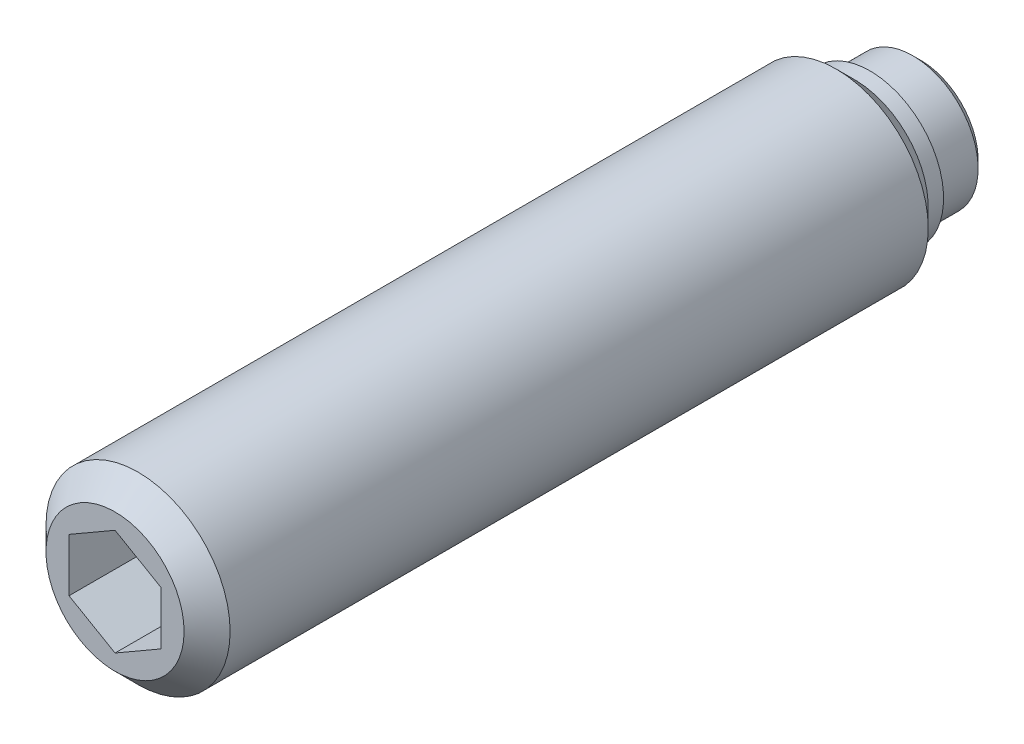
ISO-10303-21;
HEADER;
FILE_DESCRIPTION(('STEP AP214'),'2;1');
FILE_NAME('part.step','',(''),(''),'','','');
FILE_SCHEMA(('AUTOMOTIVE_DESIGN { 1 0 10303 214 1 1 1 1 }'));
ENDSEC;
DATA;
#1=APPLICATION_CONTEXT('core data for automotive mechanical design processes');
#2=APPLICATION_PROTOCOL_DEFINITION('international standard','automotive_design',2000,#1);
#3=PRODUCT_CONTEXT('',#1,'mechanical');
#4=PRODUCT('Part','Part','',(#3));
#5=PRODUCT_RELATED_PRODUCT_CATEGORY('part','',(#4));
#6=PRODUCT_DEFINITION_FORMATION('','',#4);
#7=PRODUCT_DEFINITION_CONTEXT('part definition',#1,'design');
#8=PRODUCT_DEFINITION('design','',#6,#7);
#9=PRODUCT_DEFINITION_SHAPE('','',#8);
#10=(LENGTH_UNIT() NAMED_UNIT(*) SI_UNIT(.MILLI.,.METRE.));
#11=(NAMED_UNIT(*) PLANE_ANGLE_UNIT() SI_UNIT($,.RADIAN.));
#12=(NAMED_UNIT(*) SI_UNIT($,.STERADIAN.) SOLID_ANGLE_UNIT());
#13=UNCERTAINTY_MEASURE_WITH_UNIT(LENGTH_MEASURE(1.E-05),#10,'distance_accuracy_value','');
#14=(GEOMETRIC_REPRESENTATION_CONTEXT(3) GLOBAL_UNCERTAINTY_ASSIGNED_CONTEXT((#13)) GLOBAL_UNIT_ASSIGNED_CONTEXT((#10,
#11,#12)) REPRESENTATION_CONTEXT('',''));
#15=CARTESIAN_POINT('',(0.,0.,0.));
#16=DIRECTION('',(0.,0.,1.));
#17=DIRECTION('',(1.,0.,0.));
#18=AXIS2_PLACEMENT_3D('',#15,#16,#17);
#19=CARTESIAN_POINT('',(0.,0.,3.3));
#20=DIRECTION('',(0.,0.,-1.));
#21=DIRECTION('',(-1.,0.,0.));
#22=AXIS2_PLACEMENT_3D('',#19,#20,#21);
#23=CYLINDRICAL_SURFACE('',#22,6.);
#24=CARTESIAN_POINT('',(0.,0.,5.5));
#25=DIRECTION('',(0.,0.,-1.));
#26=DIRECTION('',(-1.,0.,0.));
#27=AXIS2_PLACEMENT_3D('',#24,#25,#26);
#28=CIRCLE('',#27,6.);
#29=CARTESIAN_POINT('',(-6.,0.,5.5));
#30=VERTEX_POINT('',#29);
#31=EDGE_CURVE('E9',#30,#30,#28,.T.);
#32=ORIENTED_EDGE('',*,*,#31,.F.);
#33=EDGE_LOOP('',(#32));
#34=FACE_BOUND('',#33,.T.);
#35=CARTESIAN_POINT('',(0.,0.,51.));
#36=DIRECTION('',(0.,0.,1.));
#37=DIRECTION('',(1.,0.,0.));
#38=AXIS2_PLACEMENT_3D('',#35,#36,#37);
#39=CIRCLE('',#38,6.);
#40=CARTESIAN_POINT('',(6.,0.,51.));
#41=VERTEX_POINT('',#40);
#42=EDGE_CURVE('E123',#41,#41,#39,.T.);
#43=ORIENTED_EDGE('',*,*,#42,.F.);
#44=EDGE_LOOP('',(#43));
#45=FACE_BOUND('',#44,.T.);
#46=ADVANCED_FACE('F14',(#34,#45),#23,.T.);
#47=CARTESIAN_POINT('',(0.,0.,5.5));
#48=DIRECTION('',(0.,0.,1.));
#49=DIRECTION('',(1.,0.,0.));
#50=AXIS2_PLACEMENT_3D('',#47,#48,#49);
#51=CONICAL_SURFACE('',#50,6.,0.785398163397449);
#52=ORIENTED_EDGE('',*,*,#31,.T.);
#53=EDGE_LOOP('',(#52));
#54=FACE_BOUND('',#53,.T.);
#55=CARTESIAN_POINT('',(0.,0.,4.3));
#56=DIRECTION('',(0.,0.,-1.));
#57=DIRECTION('',(-1.,0.,0.));
#58=AXIS2_PLACEMENT_3D('',#55,#56,#57);
#59=CIRCLE('',#58,4.8);
#60=CARTESIAN_POINT('',(-4.8,0.,4.3));
#61=VERTEX_POINT('',#60);
#62=EDGE_CURVE('E21',#61,#61,#59,.T.);
#63=ORIENTED_EDGE('',*,*,#62,.F.);
#64=EDGE_LOOP('',(#63));
#65=FACE_BOUND('',#64,.T.);
#66=ADVANCED_FACE('F143',(#54,#65),#51,.T.);
#67=CARTESIAN_POINT('',(0.,0.,3.3));
#68=DIRECTION('',(0.,0.,-1.));
#69=DIRECTION('',(-1.,0.,0.));
#70=AXIS2_PLACEMENT_3D('',#67,#68,#69);
#71=CYLINDRICAL_SURFACE('',#70,4.8);
#72=ORIENTED_EDGE('',*,*,#62,.T.);
#73=EDGE_LOOP('',(#72));
#74=FACE_BOUND('',#73,.T.);
#75=CARTESIAN_POINT('',(0.,0.,3.3));
#76=DIRECTION('',(0.,0.,-1.));
#77=DIRECTION('',(-1.,0.,0.));
#78=AXIS2_PLACEMENT_3D('',#75,#76,#77);
#79=CIRCLE('',#78,4.8);
#80=CARTESIAN_POINT('',(-4.8,0.,3.3));
#81=VERTEX_POINT('',#80);
#82=EDGE_CURVE('E135',#81,#81,#79,.T.);
#83=ORIENTED_EDGE('',*,*,#82,.F.);
#84=EDGE_LOOP('',(#83));
#85=FACE_BOUND('',#84,.T.);
#86=ADVANCED_FACE('F140',(#74,#85),#71,.T.);
#87=CARTESIAN_POINT('',(0.,4.8,3.3));
#88=DIRECTION('',(0.,0.,1.));
#89=DIRECTION('',(1.,0.,0.));
#90=AXIS2_PLACEMENT_3D('',#87,#88,#89);
#91=PLANE('',#90);
#92=ORIENTED_EDGE('',*,*,#82,.T.);
#93=EDGE_LOOP('',(#92));
#94=FACE_BOUND('',#93,.T.);
#95=CARTESIAN_POINT('',(0.,0.,3.3));
#96=DIRECTION('',(0.,0.,-1.));
#97=DIRECTION('',(-1.,0.,0.));
#98=AXIS2_PLACEMENT_3D('',#95,#96,#97);
#99=CIRCLE('',#98,4.25);
#100=CARTESIAN_POINT('',(-4.25,0.,3.3));
#101=VERTEX_POINT('',#100);
#102=EDGE_CURVE('E132',#101,#101,#99,.T.);
#103=ORIENTED_EDGE('',*,*,#102,.F.);
#104=EDGE_LOOP('',(#103));
#105=FACE_BOUND('',#104,.T.);
#106=ADVANCED_FACE('F151',(#94,#105),#91,.F.);
#107=CARTESIAN_POINT('',(0.,0.,0.));
#108=DIRECTION('',(0.,0.,-1.));
#109=DIRECTION('',(-1.,0.,0.));
#110=AXIS2_PLACEMENT_3D('',#107,#108,#109);
#111=CYLINDRICAL_SURFACE('',#110,4.25);
#112=CARTESIAN_POINT('',(0.,0.,0.5));
#113=DIRECTION('',(0.,0.,-1.));
#114=DIRECTION('',(-1.,0.,0.));
#115=AXIS2_PLACEMENT_3D('',#112,#113,#114);
#116=CIRCLE('',#115,4.25);
#117=CARTESIAN_POINT('',(-4.25,0.,0.5));
#118=VERTEX_POINT('',#117);
#119=EDGE_CURVE('E129',#118,#118,#116,.T.);
#120=ORIENTED_EDGE('',*,*,#119,.F.);
#121=EDGE_LOOP('',(#120));
#122=FACE_BOUND('',#121,.T.);
#123=ORIENTED_EDGE('',*,*,#102,.T.);
#124=EDGE_LOOP('',(#123));
#125=FACE_BOUND('',#124,.T.);
#126=ADVANCED_FACE('F157',(#122,#125),#111,.T.);
#127=CARTESIAN_POINT('',(0.,0.,0.5));
#128=DIRECTION('',(0.,0.,1.));
#129=DIRECTION('',(1.,0.,0.));
#130=AXIS2_PLACEMENT_3D('',#127,#128,#129);
#131=CONICAL_SURFACE('',#130,4.25,0.785398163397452);
#132=CARTESIAN_POINT('',(0.,0.,0.));
#133=DIRECTION('',(0.,0.,-1.));
#134=DIRECTION('',(-1.,0.,0.));
#135=AXIS2_PLACEMENT_3D('',#132,#133,#134);
#136=CIRCLE('',#135,3.75);
#137=CARTESIAN_POINT('',(-3.75,0.,0.));
#138=VERTEX_POINT('',#137);
#139=EDGE_CURVE('E126',#138,#138,#136,.T.);
#140=ORIENTED_EDGE('',*,*,#139,.F.);
#141=EDGE_LOOP('',(#140));
#142=FACE_BOUND('',#141,.T.);
#143=ORIENTED_EDGE('',*,*,#119,.T.);
#144=EDGE_LOOP('',(#143));
#145=FACE_BOUND('',#144,.T.);
#146=ADVANCED_FACE('F161',(#142,#145),#131,.T.);
#147=CARTESIAN_POINT('',(0.,3.75,0.));
#148=DIRECTION('',(0.,0.,1.));
#149=DIRECTION('',(1.,0.,0.));
#150=AXIS2_PLACEMENT_3D('',#147,#148,#149);
#151=PLANE('',#150);
#152=ORIENTED_EDGE('',*,*,#139,.T.);
#153=EDGE_LOOP('',(#152));
#154=FACE_BOUND('',#153,.T.);
#155=ADVANCED_FACE('F165',(#154),#151,.F.);
#156=CARTESIAN_POINT('',(0.,0.,52.5));
#157=DIRECTION('',(0.,0.,-1.));
#158=DIRECTION('',(-1.,0.,0.));
#159=AXIS2_PLACEMENT_3D('',#156,#157,#158);
#160=CONICAL_SURFACE('',#159,4.5,0.78539816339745);
#161=ORIENTED_EDGE('',*,*,#42,.T.);
#162=EDGE_LOOP('',(#161));
#163=FACE_BOUND('',#162,.T.);
#164=CARTESIAN_POINT('',(0.,0.,52.5));
#165=DIRECTION('',(0.,0.,1.));
#166=DIRECTION('',(1.,0.,0.));
#167=AXIS2_PLACEMENT_3D('',#164,#165,#166);
#168=CIRCLE('',#167,4.5);
#169=CARTESIAN_POINT('',(4.5,0.,52.5));
#170=VERTEX_POINT('',#169);
#171=EDGE_CURVE('E115',#170,#170,#168,.T.);
#172=ORIENTED_EDGE('',*,*,#171,.F.);
#173=EDGE_LOOP('',(#172));
#174=FACE_BOUND('',#173,.T.);
#175=ADVANCED_FACE('F169',(#163,#174),#160,.T.);
#176=CARTESIAN_POINT('',(0.,-4.5,52.5));
#177=DIRECTION('',(0.,0.,1.));
#178=DIRECTION('',(1.,0.,0.));
#179=AXIS2_PLACEMENT_3D('',#176,#177,#178);
#180=PLANE('',#179);
#181=DIRECTION('',(0.866025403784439,-0.5,0.));
#182=VECTOR('',#181,1.);
#183=CARTESIAN_POINT('',(-3.,-1.73205080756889,52.5));
#184=LINE('',#183,#182);
#185=CARTESIAN_POINT('',(-3.,-1.73205080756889,52.5));
#186=VERTEX_POINT('',#185);
#187=CARTESIAN_POINT('',(0.,-3.46410161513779,52.5));
#188=VERTEX_POINT('',#187);
#189=EDGE_CURVE('E28',#186,#188,#184,.T.);
#190=ORIENTED_EDGE('',*,*,#189,.F.);
#191=DIRECTION('',(0.,-1.,0.));
#192=VECTOR('',#191,1.);
#193=CARTESIAN_POINT('',(-3.,1.73205080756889,52.5));
#194=LINE('',#193,#192);
#195=CARTESIAN_POINT('',(-3.,1.73205080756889,52.5));
#196=VERTEX_POINT('',#195);
#197=EDGE_CURVE('E111',#196,#186,#194,.T.);
#198=ORIENTED_EDGE('',*,*,#197,.F.);
#199=DIRECTION('',(-0.866025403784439,-0.5,0.));
#200=VECTOR('',#199,1.);
#201=CARTESIAN_POINT('',(0.,3.46410161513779,52.5));
#202=LINE('',#201,#200);
#203=CARTESIAN_POINT('',(0.,3.46410161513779,52.5));
#204=VERTEX_POINT('',#203);
#205=EDGE_CURVE('E109',#204,#196,#202,.T.);
#206=ORIENTED_EDGE('',*,*,#205,.F.);
#207=DIRECTION('',(-0.866025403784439,0.5,0.));
#208=VECTOR('',#207,1.);
#209=CARTESIAN_POINT('',(3.,1.73205080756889,52.5));
#210=LINE('',#209,#208);
#211=CARTESIAN_POINT('',(3.,1.73205080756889,52.5));
#212=VERTEX_POINT('',#211);
#213=EDGE_CURVE('E76',#212,#204,#210,.T.);
#214=ORIENTED_EDGE('',*,*,#213,.F.);
#215=DIRECTION('',(0.,1.,0.));
#216=VECTOR('',#215,1.);
#217=CARTESIAN_POINT('',(3.,-1.73205080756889,52.5));
#218=LINE('',#217,#216);
#219=CARTESIAN_POINT('',(3.,-1.73205080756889,52.5));
#220=VERTEX_POINT('',#219);
#221=EDGE_CURVE('E105',#220,#212,#218,.T.);
#222=ORIENTED_EDGE('',*,*,#221,.F.);
#223=DIRECTION('',(0.866025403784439,0.5,0.));
#224=VECTOR('',#223,1.);
#225=CARTESIAN_POINT('',(0.,-3.46410161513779,52.5));
#226=LINE('',#225,#224);
#227=EDGE_CURVE('E102',#188,#220,#226,.T.);
#228=ORIENTED_EDGE('',*,*,#227,.F.);
#229=EDGE_LOOP('',(#190,#198,#206,#214,#222,#228));
#230=FACE_BOUND('',#229,.T.);
#231=ORIENTED_EDGE('',*,*,#171,.T.);
#232=EDGE_LOOP('',(#231));
#233=FACE_BOUND('',#232,.T.);
#234=ADVANCED_FACE('F173',(#230,#233),#180,.T.);
#235=CARTESIAN_POINT('',(-3.,-1.73205080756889,44.5));
#236=DIRECTION('',(-0.5,-0.866025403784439,0.));
#237=DIRECTION('',(0.866025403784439,-0.5,0.));
#238=AXIS2_PLACEMENT_3D('',#235,#236,#237);
#239=PLANE('',#238);
#240=ORIENTED_EDGE('',*,*,#189,.T.);
#241=DIRECTION('',(0.,0.,1.));
#242=VECTOR('',#241,1.);
#243=CARTESIAN_POINT('',(0.,-3.46410161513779,44.5));
#244=LINE('',#243,#242);
#245=CARTESIAN_POINT('',(0.,-3.46410161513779,44.5));
#246=VERTEX_POINT('',#245);
#247=EDGE_CURVE('E58',#246,#188,#244,.T.);
#248=ORIENTED_EDGE('',*,*,#247,.F.);
#249=DIRECTION('',(0.866025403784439,-0.5,0.));
#250=VECTOR('',#249,1.);
#251=CARTESIAN_POINT('',(-3.,-1.73205080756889,44.5));
#252=LINE('',#251,#250);
#253=CARTESIAN_POINT('',(-3.,-1.73205080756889,44.5));
#254=VERTEX_POINT('',#253);
#255=EDGE_CURVE('E113',#254,#246,#252,.T.);
#256=ORIENTED_EDGE('',*,*,#255,.F.);
#257=DIRECTION('',(0.,0.,1.));
#258=VECTOR('',#257,1.);
#259=CARTESIAN_POINT('',(-3.,-1.73205080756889,44.5));
#260=LINE('',#259,#258);
#261=EDGE_CURVE('E36',#254,#186,#260,.T.);
#262=ORIENTED_EDGE('',*,*,#261,.T.);
#263=EDGE_LOOP('',(#240,#248,#256,#262));
#264=FACE_BOUND('',#263,.T.);
#265=ADVANCED_FACE('F177',(#264),#239,.F.);
#266=CARTESIAN_POINT('',(-3.,1.73205080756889,44.5));
#267=DIRECTION('',(-1.,0.,0.));
#268=DIRECTION('',(0.,0.,1.));
#269=AXIS2_PLACEMENT_3D('',#266,#267,#268);
#270=PLANE('',#269);
#271=ORIENTED_EDGE('',*,*,#197,.T.);
#272=ORIENTED_EDGE('',*,*,#261,.F.);
#273=DIRECTION('',(0.,-1.,0.));
#274=VECTOR('',#273,1.);
#275=CARTESIAN_POINT('',(-3.,1.73205080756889,44.5));
#276=LINE('',#275,#274);
#277=CARTESIAN_POINT('',(-3.,1.73205080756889,44.5));
#278=VERTEX_POINT('',#277);
#279=EDGE_CURVE('E88',#278,#254,#276,.T.);
#280=ORIENTED_EDGE('',*,*,#279,.F.);
#281=DIRECTION('',(0.,0.,1.));
#282=VECTOR('',#281,1.);
#283=CARTESIAN_POINT('',(-3.,1.73205080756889,44.5));
#284=LINE('',#283,#282);
#285=EDGE_CURVE('E80',#278,#196,#284,.T.);
#286=ORIENTED_EDGE('',*,*,#285,.T.);
#287=EDGE_LOOP('',(#271,#272,#280,#286));
#288=FACE_BOUND('',#287,.T.);
#289=ADVANCED_FACE('F181',(#288),#270,.F.);
#290=CARTESIAN_POINT('',(0.,3.46410161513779,44.5));
#291=DIRECTION('',(-0.5,0.866025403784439,0.));
#292=DIRECTION('',(-0.866025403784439,-0.5,0.));
#293=AXIS2_PLACEMENT_3D('',#290,#291,#292);
#294=PLANE('',#293);
#295=ORIENTED_EDGE('',*,*,#205,.T.);
#296=ORIENTED_EDGE('',*,*,#285,.F.);
#297=DIRECTION('',(-0.866025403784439,-0.5,0.));
#298=VECTOR('',#297,1.);
#299=CARTESIAN_POINT('',(0.,3.46410161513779,44.5));
#300=LINE('',#299,#298);
#301=CARTESIAN_POINT('',(0.,3.46410161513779,44.5));
#302=VERTEX_POINT('',#301);
#303=EDGE_CURVE('E84',#302,#278,#300,.T.);
#304=ORIENTED_EDGE('',*,*,#303,.F.);
#305=DIRECTION('',(0.,0.,1.));
#306=VECTOR('',#305,1.);
#307=CARTESIAN_POINT('',(0.,3.46410161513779,44.5));
#308=LINE('',#307,#306);
#309=EDGE_CURVE('E69',#302,#204,#308,.T.);
#310=ORIENTED_EDGE('',*,*,#309,.T.);
#311=EDGE_LOOP('',(#295,#296,#304,#310));
#312=FACE_BOUND('',#311,.T.);
#313=ADVANCED_FACE('F85',(#312),#294,.F.);
#314=CARTESIAN_POINT('',(3.,1.73205080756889,44.5));
#315=DIRECTION('',(0.5,0.866025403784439,0.));
#316=DIRECTION('',(-0.866025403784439,0.5,0.));
#317=AXIS2_PLACEMENT_3D('',#314,#315,#316);
#318=PLANE('',#317);
#319=ORIENTED_EDGE('',*,*,#213,.T.);
#320=ORIENTED_EDGE('',*,*,#309,.F.);
#321=DIRECTION('',(-0.866025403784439,0.5,0.));
#322=VECTOR('',#321,1.);
#323=CARTESIAN_POINT('',(3.,1.73205080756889,44.5));
#324=LINE('',#323,#322);
#325=CARTESIAN_POINT('',(3.,1.73205080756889,44.5));
#326=VERTEX_POINT('',#325);
#327=EDGE_CURVE('E73',#326,#302,#324,.T.);
#328=ORIENTED_EDGE('',*,*,#327,.F.);
#329=DIRECTION('',(0.,0.,1.));
#330=VECTOR('',#329,1.);
#331=CARTESIAN_POINT('',(3.,1.73205080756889,44.5));
#332=LINE('',#331,#330);
#333=EDGE_CURVE('E81',#326,#212,#332,.T.);
#334=ORIENTED_EDGE('',*,*,#333,.T.);
#335=EDGE_LOOP('',(#319,#320,#328,#334));
#336=FACE_BOUND('',#335,.T.);
#337=ADVANCED_FACE('F71',(#336),#318,.F.);
#338=CARTESIAN_POINT('',(3.,-1.73205080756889,44.5));
#339=DIRECTION('',(1.,0.,0.));
#340=DIRECTION('',(0.,0.,-1.));
#341=AXIS2_PLACEMENT_3D('',#338,#339,#340);
#342=PLANE('',#341);
#343=ORIENTED_EDGE('',*,*,#221,.T.);
#344=ORIENTED_EDGE('',*,*,#333,.F.);
#345=DIRECTION('',(0.,1.,0.));
#346=VECTOR('',#345,1.);
#347=CARTESIAN_POINT('',(3.,-1.73205080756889,44.5));
#348=LINE('',#347,#346);
#349=CARTESIAN_POINT('',(3.,-1.73205080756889,44.5));
#350=VERTEX_POINT('',#349);
#351=EDGE_CURVE('E94',#350,#326,#348,.T.);
#352=ORIENTED_EDGE('',*,*,#351,.F.);
#353=DIRECTION('',(0.,0.,1.));
#354=VECTOR('',#353,1.);
#355=CARTESIAN_POINT('',(3.,-1.73205080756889,44.5));
#356=LINE('',#355,#354);
#357=EDGE_CURVE('E118',#350,#220,#356,.T.);
#358=ORIENTED_EDGE('',*,*,#357,.T.);
#359=EDGE_LOOP('',(#343,#344,#352,#358));
#360=FACE_BOUND('',#359,.T.);
#361=ADVANCED_FACE('F185',(#360),#342,.F.);
#362=CARTESIAN_POINT('',(0.,-3.46410161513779,44.5));
#363=DIRECTION('',(0.5,-0.866025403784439,0.));
#364=DIRECTION('',(0.866025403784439,0.5,0.));
#365=AXIS2_PLACEMENT_3D('',#362,#363,#364);
#366=PLANE('',#365);
#367=ORIENTED_EDGE('',*,*,#227,.T.);
#368=ORIENTED_EDGE('',*,*,#357,.F.);
#369=DIRECTION('',(0.866025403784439,0.5,0.));
#370=VECTOR('',#369,1.);
#371=CARTESIAN_POINT('',(0.,-3.46410161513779,44.5));
#372=LINE('',#371,#370);
#373=EDGE_CURVE('E96',#246,#350,#372,.T.);
#374=ORIENTED_EDGE('',*,*,#373,.F.);
#375=ORIENTED_EDGE('',*,*,#247,.T.);
#376=EDGE_LOOP('',(#367,#368,#374,#375));
#377=FACE_BOUND('',#376,.T.);
#378=ADVANCED_FACE('F182',(#377),#366,.F.);
#379=CARTESIAN_POINT('',(0.,0.,44.5));
#380=DIRECTION('',(0.,0.,1.));
#381=DIRECTION('',(1.,0.,0.));
#382=AXIS2_PLACEMENT_3D('',#379,#380,#381);
#383=PLANE('',#382);
#384=ORIENTED_EDGE('',*,*,#255,.T.);
#385=ORIENTED_EDGE('',*,*,#373,.T.);
#386=ORIENTED_EDGE('',*,*,#351,.T.);
#387=ORIENTED_EDGE('',*,*,#327,.T.);
#388=ORIENTED_EDGE('',*,*,#303,.T.);
#389=ORIENTED_EDGE('',*,*,#279,.T.);
#390=EDGE_LOOP('',(#384,#385,#386,#387,#388,#389));
#391=FACE_BOUND('',#390,.T.);
#392=ADVANCED_FACE('F91',(#391),#383,.T.);
#393=CLOSED_SHELL('',(#46,#66,#86,#106,#126,#146,#155,#175,#234,#265,#289,#313,#337,#361,#378,#392));
#394=MANIFOLD_SOLID_BREP('B1',#393);
#395=ADVANCED_BREP_SHAPE_REPRESENTATION('',(#18,#394),#14);
#396=SHAPE_DEFINITION_REPRESENTATION(#9,#395);
ENDSEC;
END-ISO-10303-21;
